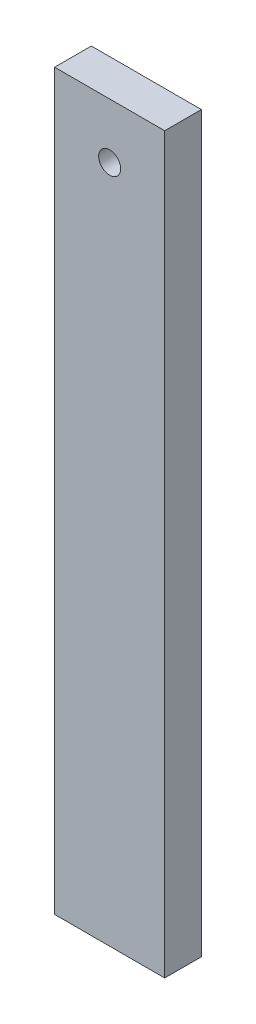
from build123d import *

# Parameters (mm, degrees)
ESQUISSE1_W        = 150
ESQUISSE1_H        = 1000
ESQUISSE1_R        = 15
BOSS_EXTRU_1_DEPTH = 50


with BuildPart() as part:
    # Esquisse1 → Boss.-Extru.1 (new body)
    with BuildSketch(Plane.XY):
        with Locations((75, 500)):
            Rectangle(ESQUISSE1_W, ESQUISSE1_H)
        with Locations((75, 925)):
            Circle(ESQUISSE1_R, mode=Mode.SUBTRACT)
    extrude(amount=BOSS_EXTRU_1_DEPTH)


solid = part.part
